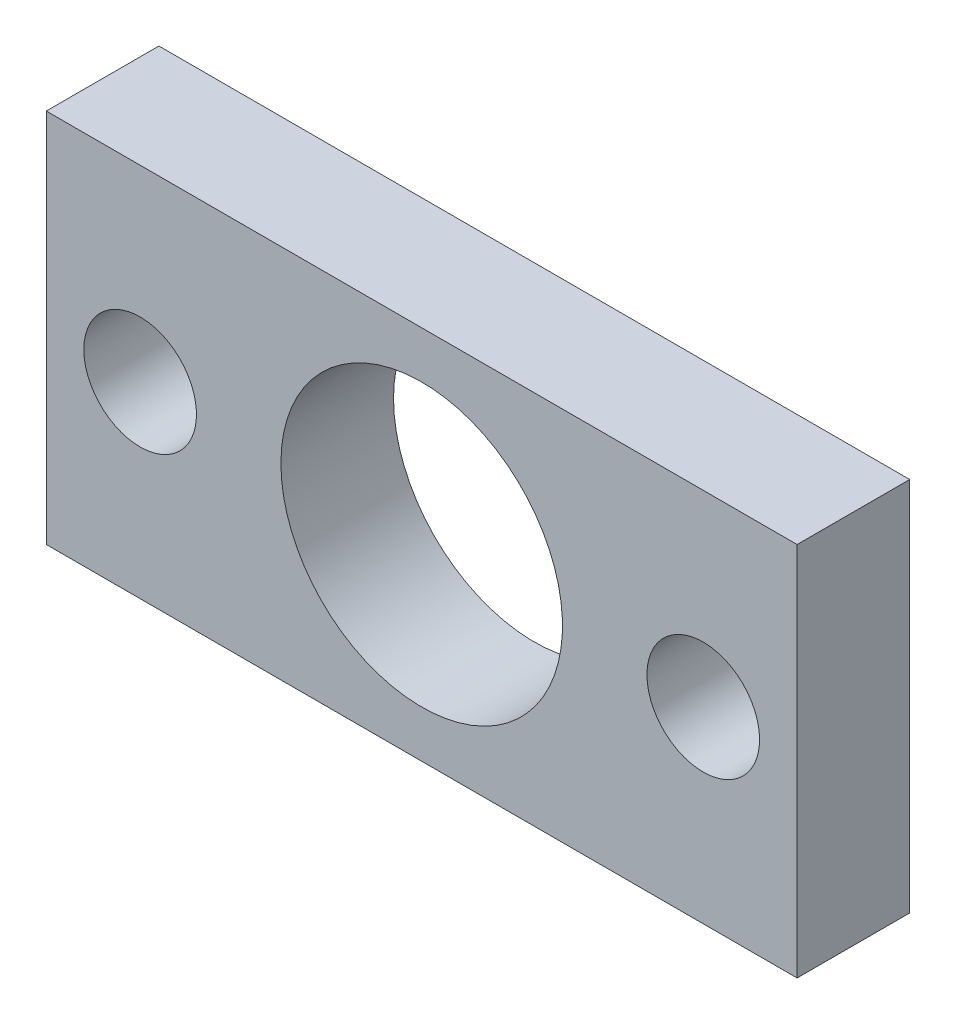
from build123d import *

# Parameters (mm, degrees)
SKETCH1_W           = 25.4
SKETCH1_H           = 12.7
SKETCH1_R           = 1.905
SKETCH1_R_2         = 4.7625
BOSS_EXTRUDE1_DEPTH = 3.81


with BuildPart() as part:
    # Sketch1 → Boss-Extrude1 (new body)
    with BuildSketch(Plane(origin=(0, 0, -6.35), x_dir=(-1, 0, 0), z_dir=(0, 0, -1))):
        with Locations((-12.7, 6.35)):
            Rectangle(SKETCH1_W, SKETCH1_H)
        with Locations((-22.225, 6.35)):
            Circle(SKETCH1_R, mode=Mode.SUBTRACT)
        with Locations((-3.175, 6.35)):
            Circle(SKETCH1_R, mode=Mode.SUBTRACT)
        with Locations((-12.7, 6.35)):
            Circle(SKETCH1_R_2, mode=Mode.SUBTRACT)
    extrude(amount=-BOSS_EXTRUDE1_DEPTH)


solid = part.part
